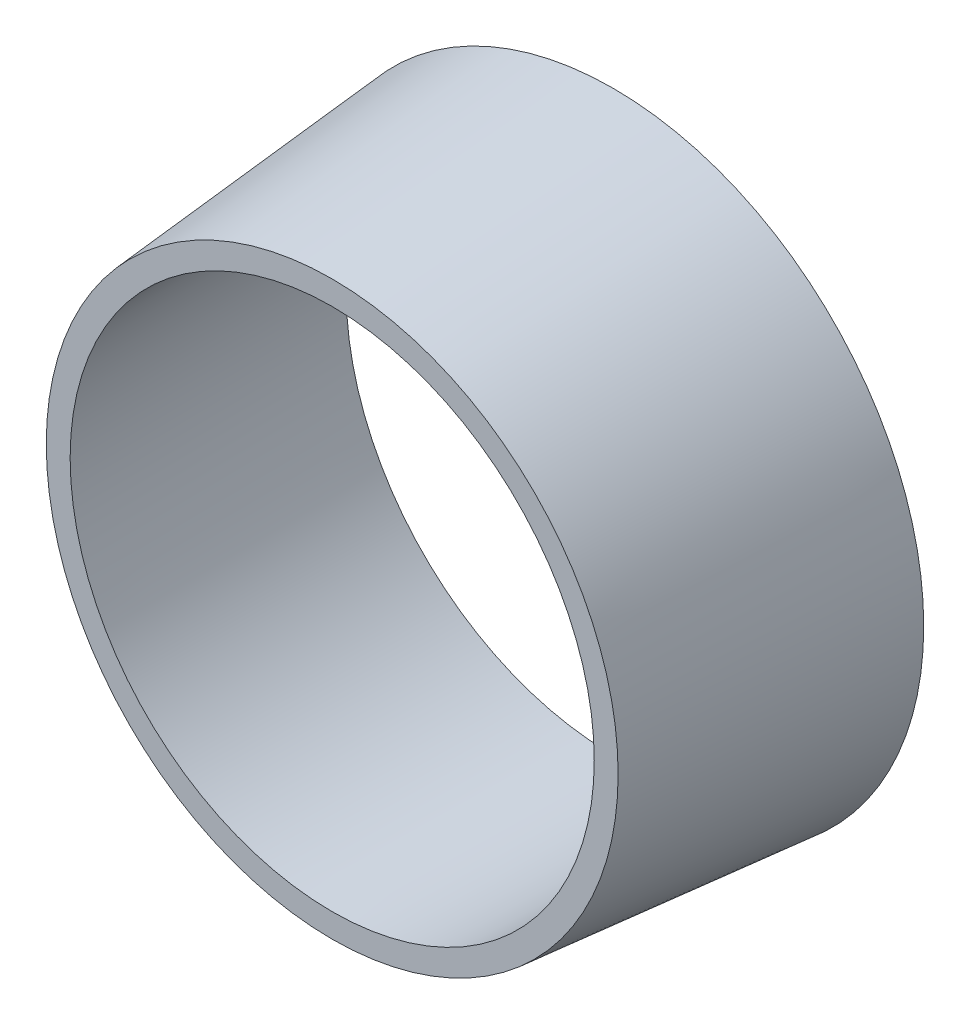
ISO-10303-21;
HEADER;
FILE_DESCRIPTION(('STEP AP214'),'2;1');
FILE_NAME('part.step','',(''),(''),'','','');
FILE_SCHEMA(('AUTOMOTIVE_DESIGN { 1 0 10303 214 1 1 1 1 }'));
ENDSEC;
DATA;
#1=APPLICATION_CONTEXT('core data for automotive mechanical design processes');
#2=APPLICATION_PROTOCOL_DEFINITION('international standard','automotive_design',2000,#1);
#3=PRODUCT_CONTEXT('',#1,'mechanical');
#4=PRODUCT('Part','Part','',(#3));
#5=PRODUCT_RELATED_PRODUCT_CATEGORY('part','',(#4));
#6=PRODUCT_DEFINITION_FORMATION('','',#4);
#7=PRODUCT_DEFINITION_CONTEXT('part definition',#1,'design');
#8=PRODUCT_DEFINITION('design','',#6,#7);
#9=PRODUCT_DEFINITION_SHAPE('','',#8);
#10=(LENGTH_UNIT() NAMED_UNIT(*) SI_UNIT(.MILLI.,.METRE.));
#11=(NAMED_UNIT(*) PLANE_ANGLE_UNIT() SI_UNIT($,.RADIAN.));
#12=(NAMED_UNIT(*) SI_UNIT($,.STERADIAN.) SOLID_ANGLE_UNIT());
#13=UNCERTAINTY_MEASURE_WITH_UNIT(LENGTH_MEASURE(1.E-05),#10,'distance_accuracy_value','');
#14=(GEOMETRIC_REPRESENTATION_CONTEXT(3) GLOBAL_UNCERTAINTY_ASSIGNED_CONTEXT((#13)) GLOBAL_UNIT_ASSIGNED_CONTEXT((#10,
#11,#12)) REPRESENTATION_CONTEXT('',''));
#15=CARTESIAN_POINT('',(0.,0.,0.));
#16=DIRECTION('',(0.,0.,1.));
#17=DIRECTION('',(1.,0.,0.));
#18=AXIS2_PLACEMENT_3D('',#15,#16,#17);
#19=CARTESIAN_POINT('',(0.,0.,0.));
#20=DIRECTION('',(0.,0.,-1.));
#21=DIRECTION('',(1.,0.,0.));
#22=AXIS2_PLACEMENT_3D('',#19,#20,#21);
#23=CONICAL_SURFACE('',#22,5.525,0.0872664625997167);
#24=CARTESIAN_POINT('',(0.,0.,5.));
#25=DIRECTION('',(0.,0.,1.));
#26=DIRECTION('',(1.,0.,0.));
#27=AXIS2_PLACEMENT_3D('',#24,#25,#26);
#28=CIRCLE('',#27,5.08755668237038);
#29=CARTESIAN_POINT('',(5.08755668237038,0.,5.));
#30=VERTEX_POINT('',#29);
#31=EDGE_CURVE('E10',#30,#30,#28,.T.);
#32=ORIENTED_EDGE('',*,*,#31,.F.);
#33=EDGE_LOOP('',(#32));
#34=FACE_BOUND('',#33,.T.);
#35=CARTESIAN_POINT('',(0.,0.,0.));
#36=DIRECTION('',(0.,0.,1.));
#37=DIRECTION('',(1.,0.,0.));
#38=AXIS2_PLACEMENT_3D('',#35,#36,#37);
#39=CIRCLE('',#38,5.525);
#40=CARTESIAN_POINT('',(5.525,0.,0.));
#41=VERTEX_POINT('',#40);
#42=EDGE_CURVE('E44',#41,#41,#39,.T.);
#43=ORIENTED_EDGE('',*,*,#42,.T.);
#44=EDGE_LOOP('',(#43));
#45=FACE_BOUND('',#44,.T.);
#46=ADVANCED_FACE('F37',(#34,#45),#23,.T.);
#47=CARTESIAN_POINT('',(0.,0.,5.));
#48=DIRECTION('',(0.,0.,1.));
#49=DIRECTION('',(1.,0.,0.));
#50=AXIS2_PLACEMENT_3D('',#47,#48,#49);
#51=PLANE('',#50);
#52=CARTESIAN_POINT('',(0.,0.,5.));
#53=DIRECTION('',(0.,0.,1.));
#54=DIRECTION('',(1.,0.,0.));
#55=AXIS2_PLACEMENT_3D('',#52,#53,#54);
#56=CIRCLE('',#55,4.66272467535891);
#57=CARTESIAN_POINT('',(4.66272467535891,0.,5.));
#58=VERTEX_POINT('',#57);
#59=EDGE_CURVE('E49',#58,#58,#56,.T.);
#60=ORIENTED_EDGE('',*,*,#59,.F.);
#61=EDGE_LOOP('',(#60));
#62=FACE_BOUND('',#61,.T.);
#63=ORIENTED_EDGE('',*,*,#31,.T.);
#64=EDGE_LOOP('',(#63));
#65=FACE_BOUND('',#64,.T.);
#66=ADVANCED_FACE('F66',(#62,#65),#51,.T.);
#67=CARTESIAN_POINT('',(0.,0.,0.));
#68=DIRECTION('',(0.,0.,1.));
#69=DIRECTION('',(1.,0.,0.));
#70=AXIS2_PLACEMENT_3D('',#67,#68,#69);
#71=PLANE('',#70);
#72=CARTESIAN_POINT('',(0.,0.,0.));
#73=DIRECTION('',(0.,0.,-1.));
#74=DIRECTION('',(-1.,0.,0.));
#75=AXIS2_PLACEMENT_3D('',#72,#73,#74);
#76=CIRCLE('',#75,4.75);
#77=CARTESIAN_POINT('',(-4.75,0.,0.));
#78=VERTEX_POINT('',#77);
#79=EDGE_CURVE('E54',#78,#78,#76,.T.);
#80=ORIENTED_EDGE('',*,*,#79,.F.);
#81=EDGE_LOOP('',(#80));
#82=FACE_BOUND('',#81,.T.);
#83=ORIENTED_EDGE('',*,*,#42,.F.);
#84=EDGE_LOOP('',(#83));
#85=FACE_BOUND('',#84,.T.);
#86=ADVANCED_FACE('F63',(#82,#85),#71,.F.);
#87=CARTESIAN_POINT('',(0.,0.,0.));
#88=DIRECTION('',(0.,0.,-1.));
#89=DIRECTION('',(-1.,0.,0.));
#90=AXIS2_PLACEMENT_3D('',#87,#88,#89);
#91=CONICAL_SURFACE('',#90,4.75,0.0174532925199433);
#92=ORIENTED_EDGE('',*,*,#59,.T.);
#93=EDGE_LOOP('',(#92));
#94=FACE_BOUND('',#93,.T.);
#95=ORIENTED_EDGE('',*,*,#79,.T.);
#96=EDGE_LOOP('',(#95));
#97=FACE_BOUND('',#96,.T.);
#98=ADVANCED_FACE('F61',(#94,#97),#91,.F.);
#99=CLOSED_SHELL('',(#46,#66,#86,#98));
#100=MANIFOLD_SOLID_BREP('B2',#99);
#101=ADVANCED_BREP_SHAPE_REPRESENTATION('',(#18,#100),#14);
#102=SHAPE_DEFINITION_REPRESENTATION(#9,#101);
ENDSEC;
END-ISO-10303-21;
